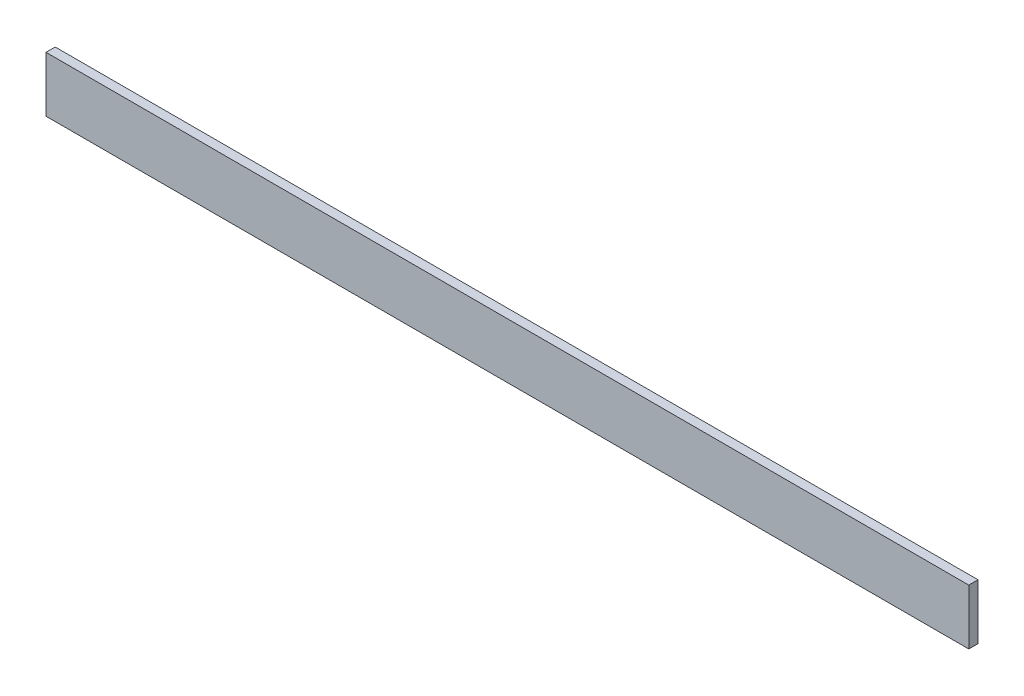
from build123d import *

# Parameters (mm, degrees)
ESQUISSE1_W      = 1000
ESQUISSE1_H      = 60
EXTRUSION1_DEPTH = 10


with BuildPart() as part:
    # Esquisse1 → Extrusion1 (new body)
    with BuildSketch(Plane.XY):
        with Locations((500, 30)):
            Rectangle(ESQUISSE1_W, ESQUISSE1_H)
    extrude(amount=EXTRUSION1_DEPTH)


solid = part.part
